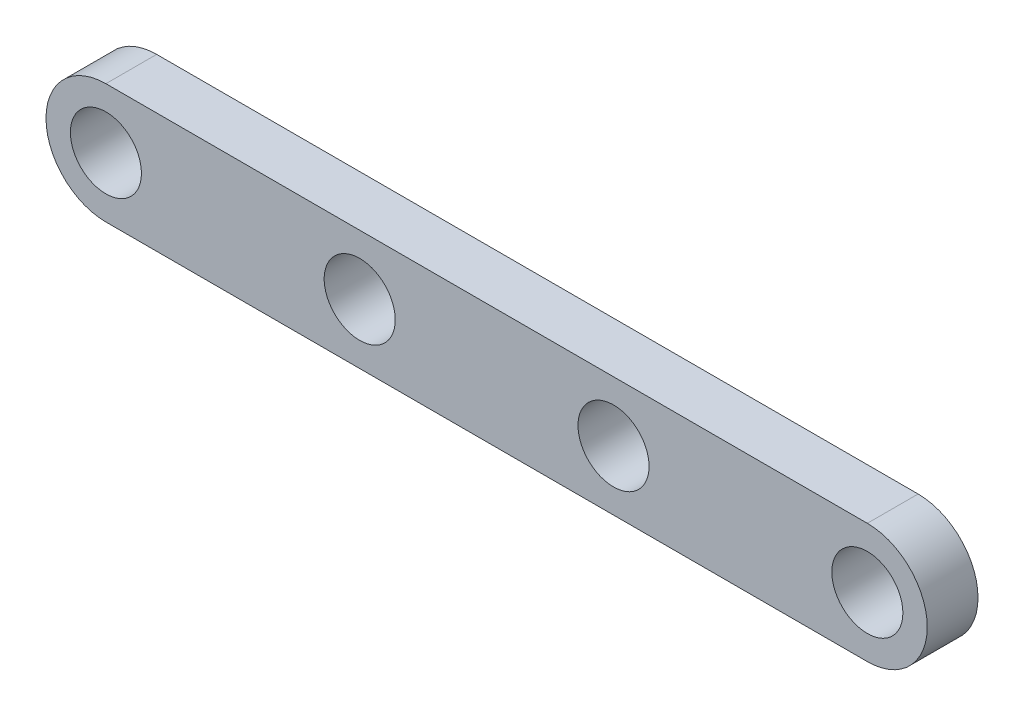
ISO-10303-21;
HEADER;
FILE_DESCRIPTION(('STEP AP214'),'2;1');
FILE_NAME('part.step','',(''),(''),'','','');
FILE_SCHEMA(('AUTOMOTIVE_DESIGN { 1 0 10303 214 1 1 1 1 }'));
ENDSEC;
DATA;
#1=APPLICATION_CONTEXT('core data for automotive mechanical design processes');
#2=APPLICATION_PROTOCOL_DEFINITION('international standard','automotive_design',2000,#1);
#3=PRODUCT_CONTEXT('',#1,'mechanical');
#4=PRODUCT('Part','Part','',(#3));
#5=PRODUCT_RELATED_PRODUCT_CATEGORY('part','',(#4));
#6=PRODUCT_DEFINITION_FORMATION('','',#4);
#7=PRODUCT_DEFINITION_CONTEXT('part definition',#1,'design');
#8=PRODUCT_DEFINITION('design','',#6,#7);
#9=PRODUCT_DEFINITION_SHAPE('','',#8);
#10=(LENGTH_UNIT() NAMED_UNIT(*) SI_UNIT(.MILLI.,.METRE.));
#11=(NAMED_UNIT(*) PLANE_ANGLE_UNIT() SI_UNIT($,.RADIAN.));
#12=(NAMED_UNIT(*) SI_UNIT($,.STERADIAN.) SOLID_ANGLE_UNIT());
#13=UNCERTAINTY_MEASURE_WITH_UNIT(LENGTH_MEASURE(1.E-05),#10,'distance_accuracy_value','');
#14=(GEOMETRIC_REPRESENTATION_CONTEXT(3) GLOBAL_UNCERTAINTY_ASSIGNED_CONTEXT((#13)) GLOBAL_UNIT_ASSIGNED_CONTEXT((#10,
#11,#12)) REPRESENTATION_CONTEXT('',''));
#15=CARTESIAN_POINT('',(0.,0.,0.));
#16=DIRECTION('',(0.,0.,1.));
#17=DIRECTION('',(1.,0.,0.));
#18=AXIS2_PLACEMENT_3D('',#15,#16,#17);
#19=CARTESIAN_POINT('',(261.537880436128,51.30188514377,2.54));
#20=DIRECTION('',(0.,0.,-1.));
#21=DIRECTION('',(-1.,0.,0.));
#22=AXIS2_PLACEMENT_3D('',#19,#20,#21);
#23=CYLINDRICAL_SURFACE('',#22,2.99720000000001);
#24=CARTESIAN_POINT('',(261.537880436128,51.30188514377,0.));
#25=DIRECTION('',(0.,0.,1.));
#26=DIRECTION('',(1.,0.,0.));
#27=AXIS2_PLACEMENT_3D('',#24,#25,#26);
#28=CIRCLE('',#27,2.99720000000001);
#29=CARTESIAN_POINT('',(261.537880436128,48.30468514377,0.));
#30=VERTEX_POINT('',#29);
#31=CARTESIAN_POINT('',(261.537880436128,54.2990851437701,0.));
#32=VERTEX_POINT('',#31);
#33=EDGE_CURVE('E96',#30,#32,#28,.T.);
#34=ORIENTED_EDGE('',*,*,#33,.T.);
#35=DIRECTION('',(0.,0.,-1.));
#36=VECTOR('',#35,1.);
#37=CARTESIAN_POINT('',(261.537880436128,54.2990851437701,2.54));
#38=LINE('',#37,#36);
#39=CARTESIAN_POINT('',(261.537880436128,54.2990851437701,2.54));
#40=VERTEX_POINT('',#39);
#41=EDGE_CURVE('E11',#40,#32,#38,.T.);
#42=ORIENTED_EDGE('',*,*,#41,.F.);
#43=CARTESIAN_POINT('',(261.537880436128,51.30188514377,2.54));
#44=DIRECTION('',(0.,0.,1.));
#45=DIRECTION('',(1.,0.,0.));
#46=AXIS2_PLACEMENT_3D('',#43,#44,#45);
#47=CIRCLE('',#46,2.99720000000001);
#48=CARTESIAN_POINT('',(261.537880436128,48.30468514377,2.54));
#49=VERTEX_POINT('',#48);
#50=EDGE_CURVE('E82',#49,#40,#47,.T.);
#51=ORIENTED_EDGE('',*,*,#50,.F.);
#52=DIRECTION('',(0.,0.,-1.));
#53=VECTOR('',#52,1.);
#54=CARTESIAN_POINT('',(261.537880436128,48.30468514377,2.54));
#55=LINE('',#54,#53);
#56=EDGE_CURVE('E49',#49,#30,#55,.T.);
#57=ORIENTED_EDGE('',*,*,#56,.T.);
#58=EDGE_LOOP('',(#34,#42,#51,#57));
#59=FACE_BOUND('',#58,.T.);
#60=ADVANCED_FACE('F33',(#59),#23,.T.);
#61=CARTESIAN_POINT('',(261.537880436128,54.2990851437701,2.54));
#62=DIRECTION('',(0.,-1.,0.));
#63=DIRECTION('',(1.,0.,0.));
#64=AXIS2_PLACEMENT_3D('',#61,#62,#63);
#65=PLANE('',#64);
#66=DIRECTION('',(-1.,0.,0.));
#67=VECTOR('',#66,1.);
#68=CARTESIAN_POINT('',(261.537880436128,54.2990851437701,0.));
#69=LINE('',#68,#67);
#70=CARTESIAN_POINT('',(223.437880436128,54.29908514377,0.));
#71=VERTEX_POINT('',#70);
#72=EDGE_CURVE('E87',#32,#71,#69,.T.);
#73=ORIENTED_EDGE('',*,*,#72,.T.);
#74=DIRECTION('',(0.,0.,-1.));
#75=VECTOR('',#74,1.);
#76=CARTESIAN_POINT('',(223.437880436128,54.29908514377,2.54));
#77=LINE('',#76,#75);
#78=CARTESIAN_POINT('',(223.437880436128,54.29908514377,2.54));
#79=VERTEX_POINT('',#78);
#80=EDGE_CURVE('E41',#79,#71,#77,.T.);
#81=ORIENTED_EDGE('',*,*,#80,.F.);
#82=DIRECTION('',(-1.,0.,0.));
#83=VECTOR('',#82,1.);
#84=CARTESIAN_POINT('',(261.537880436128,54.2990851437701,2.54));
#85=LINE('',#84,#83);
#86=EDGE_CURVE('E75',#40,#79,#85,.T.);
#87=ORIENTED_EDGE('',*,*,#86,.F.);
#88=ORIENTED_EDGE('',*,*,#41,.T.);
#89=EDGE_LOOP('',(#73,#81,#87,#88));
#90=FACE_BOUND('',#89,.T.);
#91=ADVANCED_FACE('F86',(#90),#65,.F.);
#92=CARTESIAN_POINT('',(223.437880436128,51.30188514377,2.54));
#93=DIRECTION('',(0.,0.,-1.));
#94=DIRECTION('',(-1.,0.,0.));
#95=AXIS2_PLACEMENT_3D('',#92,#93,#94);
#96=CYLINDRICAL_SURFACE('',#95,2.99719999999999);
#97=CARTESIAN_POINT('',(223.437880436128,51.30188514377,0.));
#98=DIRECTION('',(0.,0.,1.));
#99=DIRECTION('',(1.,0.,0.));
#100=AXIS2_PLACEMENT_3D('',#97,#98,#99);
#101=CIRCLE('',#100,2.99719999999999);
#102=CARTESIAN_POINT('',(223.437880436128,48.3046851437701,0.));
#103=VERTEX_POINT('',#102);
#104=EDGE_CURVE('E100',#71,#103,#101,.T.);
#105=ORIENTED_EDGE('',*,*,#104,.T.);
#106=DIRECTION('',(0.,0.,-1.));
#107=VECTOR('',#106,1.);
#108=CARTESIAN_POINT('',(223.437880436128,48.3046851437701,2.54));
#109=LINE('',#108,#107);
#110=CARTESIAN_POINT('',(223.437880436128,48.3046851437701,2.54));
#111=VERTEX_POINT('',#110);
#112=EDGE_CURVE('E64',#111,#103,#109,.T.);
#113=ORIENTED_EDGE('',*,*,#112,.F.);
#114=CARTESIAN_POINT('',(223.437880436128,51.30188514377,2.54));
#115=DIRECTION('',(0.,0.,1.));
#116=DIRECTION('',(1.,0.,0.));
#117=AXIS2_PLACEMENT_3D('',#114,#115,#116);
#118=CIRCLE('',#117,2.99719999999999);
#119=EDGE_CURVE('E81',#79,#111,#118,.T.);
#120=ORIENTED_EDGE('',*,*,#119,.F.);
#121=ORIENTED_EDGE('',*,*,#80,.T.);
#122=EDGE_LOOP('',(#105,#113,#120,#121));
#123=FACE_BOUND('',#122,.T.);
#124=ADVANCED_FACE('F90',(#123),#96,.T.);
#125=CARTESIAN_POINT('',(261.537880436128,48.30468514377,2.54));
#126=DIRECTION('',(0.,-1.,0.));
#127=DIRECTION('',(0.,0.,-1.));
#128=AXIS2_PLACEMENT_3D('',#125,#126,#127);
#129=PLANE('',#128);
#130=DIRECTION('',(-1.,0.,0.));
#131=VECTOR('',#130,1.);
#132=CARTESIAN_POINT('',(261.537880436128,48.30468514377,0.));
#133=LINE('',#132,#131);
#134=EDGE_CURVE('E102',#30,#103,#133,.T.);
#135=ORIENTED_EDGE('',*,*,#134,.F.);
#136=ORIENTED_EDGE('',*,*,#56,.F.);
#137=DIRECTION('',(-1.,0.,0.));
#138=VECTOR('',#137,1.);
#139=CARTESIAN_POINT('',(261.537880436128,48.30468514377,2.54));
#140=LINE('',#139,#138);
#141=EDGE_CURVE('E91',#49,#111,#140,.T.);
#142=ORIENTED_EDGE('',*,*,#141,.T.);
#143=ORIENTED_EDGE('',*,*,#112,.T.);
#144=EDGE_LOOP('',(#135,#136,#142,#143));
#145=FACE_BOUND('',#144,.T.);
#146=ADVANCED_FACE('F138',(#145),#129,.T.);
#147=CARTESIAN_POINT('',(261.537880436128,51.30188514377,2.54));
#148=DIRECTION('',(0.,0.,1.));
#149=DIRECTION('',(1.,0.,0.));
#150=AXIS2_PLACEMENT_3D('',#147,#148,#149);
#151=PLANE('',#150);
#152=CARTESIAN_POINT('',(223.437880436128,51.30188514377,2.54));
#153=DIRECTION('',(0.,0.,1.));
#154=DIRECTION('',(1.,0.,0.));
#155=AXIS2_PLACEMENT_3D('',#152,#153,#154);
#156=CIRCLE('',#155,1.778);
#157=CARTESIAN_POINT('',(225.215880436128,51.30188514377,2.54));
#158=VERTEX_POINT('',#157);
#159=EDGE_CURVE('E98',#158,#158,#156,.T.);
#160=ORIENTED_EDGE('',*,*,#159,.F.);
#161=EDGE_LOOP('',(#160));
#162=FACE_BOUND('',#161,.T.);
#163=CARTESIAN_POINT('',(236.137880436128,51.30188514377,2.54));
#164=DIRECTION('',(0.,0.,1.));
#165=DIRECTION('',(1.,0.,0.));
#166=AXIS2_PLACEMENT_3D('',#163,#164,#165);
#167=CIRCLE('',#166,1.778);
#168=CARTESIAN_POINT('',(237.915880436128,51.30188514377,2.54));
#169=VERTEX_POINT('',#168);
#170=EDGE_CURVE('E123',#169,#169,#167,.T.);
#171=ORIENTED_EDGE('',*,*,#170,.F.);
#172=EDGE_LOOP('',(#171));
#173=FACE_BOUND('',#172,.T.);
#174=CARTESIAN_POINT('',(248.837880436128,51.30188514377,2.54));
#175=DIRECTION('',(0.,0.,1.));
#176=DIRECTION('',(1.,0.,0.));
#177=AXIS2_PLACEMENT_3D('',#174,#175,#176);
#178=CIRCLE('',#177,1.77799999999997);
#179=CARTESIAN_POINT('',(250.615880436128,51.30188514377,2.54));
#180=VERTEX_POINT('',#179);
#181=EDGE_CURVE('E117',#180,#180,#178,.T.);
#182=ORIENTED_EDGE('',*,*,#181,.F.);
#183=EDGE_LOOP('',(#182));
#184=FACE_BOUND('',#183,.T.);
#185=CARTESIAN_POINT('',(261.537880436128,51.30188514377,2.54));
#186=DIRECTION('',(0.,0.,1.));
#187=DIRECTION('',(1.,0.,0.));
#188=AXIS2_PLACEMENT_3D('',#185,#186,#187);
#189=CIRCLE('',#188,1.778);
#190=CARTESIAN_POINT('',(263.315880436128,51.30188514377,2.54));
#191=VERTEX_POINT('',#190);
#192=EDGE_CURVE('E111',#191,#191,#189,.T.);
#193=ORIENTED_EDGE('',*,*,#192,.F.);
#194=EDGE_LOOP('',(#193));
#195=FACE_BOUND('',#194,.T.);
#196=ORIENTED_EDGE('',*,*,#50,.T.);
#197=ORIENTED_EDGE('',*,*,#86,.T.);
#198=ORIENTED_EDGE('',*,*,#119,.T.);
#199=ORIENTED_EDGE('',*,*,#141,.F.);
#200=EDGE_LOOP('',(#196,#197,#198,#199));
#201=FACE_BOUND('',#200,.T.);
#202=ADVANCED_FACE('F78',(#162,#173,#184,#195,#201),#151,.T.);
#203=CARTESIAN_POINT('',(261.537880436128,51.30188514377,0.));
#204=DIRECTION('',(0.,0.,1.));
#205=DIRECTION('',(1.,0.,0.));
#206=AXIS2_PLACEMENT_3D('',#203,#204,#205);
#207=PLANE('',#206);
#208=CARTESIAN_POINT('',(223.437880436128,51.30188514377,0.));
#209=DIRECTION('',(0.,0.,1.));
#210=DIRECTION('',(1.,0.,0.));
#211=AXIS2_PLACEMENT_3D('',#208,#209,#210);
#212=CIRCLE('',#211,1.778);
#213=CARTESIAN_POINT('',(225.215880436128,51.30188514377,0.));
#214=VERTEX_POINT('',#213);
#215=EDGE_CURVE('E126',#214,#214,#212,.T.);
#216=ORIENTED_EDGE('',*,*,#215,.T.);
#217=EDGE_LOOP('',(#216));
#218=FACE_BOUND('',#217,.T.);
#219=CARTESIAN_POINT('',(236.137880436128,51.30188514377,0.));
#220=DIRECTION('',(0.,0.,1.));
#221=DIRECTION('',(1.,0.,0.));
#222=AXIS2_PLACEMENT_3D('',#219,#220,#221);
#223=CIRCLE('',#222,1.778);
#224=CARTESIAN_POINT('',(237.915880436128,51.30188514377,0.));
#225=VERTEX_POINT('',#224);
#226=EDGE_CURVE('E120',#225,#225,#223,.T.);
#227=ORIENTED_EDGE('',*,*,#226,.T.);
#228=EDGE_LOOP('',(#227));
#229=FACE_BOUND('',#228,.T.);
#230=CARTESIAN_POINT('',(248.837880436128,51.30188514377,0.));
#231=DIRECTION('',(0.,0.,1.));
#232=DIRECTION('',(1.,0.,0.));
#233=AXIS2_PLACEMENT_3D('',#230,#231,#232);
#234=CIRCLE('',#233,1.77799999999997);
#235=CARTESIAN_POINT('',(250.615880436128,51.30188514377,0.));
#236=VERTEX_POINT('',#235);
#237=EDGE_CURVE('E114',#236,#236,#234,.T.);
#238=ORIENTED_EDGE('',*,*,#237,.T.);
#239=EDGE_LOOP('',(#238));
#240=FACE_BOUND('',#239,.T.);
#241=CARTESIAN_POINT('',(261.537880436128,51.30188514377,0.));
#242=DIRECTION('',(0.,0.,1.));
#243=DIRECTION('',(1.,0.,0.));
#244=AXIS2_PLACEMENT_3D('',#241,#242,#243);
#245=CIRCLE('',#244,1.778);
#246=CARTESIAN_POINT('',(263.315880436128,51.30188514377,0.));
#247=VERTEX_POINT('',#246);
#248=EDGE_CURVE('E108',#247,#247,#245,.T.);
#249=ORIENTED_EDGE('',*,*,#248,.T.);
#250=EDGE_LOOP('',(#249));
#251=FACE_BOUND('',#250,.T.);
#252=ORIENTED_EDGE('',*,*,#33,.F.);
#253=ORIENTED_EDGE('',*,*,#134,.T.);
#254=ORIENTED_EDGE('',*,*,#104,.F.);
#255=ORIENTED_EDGE('',*,*,#72,.F.);
#256=EDGE_LOOP('',(#252,#253,#254,#255));
#257=FACE_BOUND('',#256,.T.);
#258=ADVANCED_FACE('F137',(#218,#229,#240,#251,#257),#207,.F.);
#259=CARTESIAN_POINT('',(261.537880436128,51.30188514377,2.54));
#260=DIRECTION('',(0.,0.,-1.));
#261=DIRECTION('',(-1.,0.,0.));
#262=AXIS2_PLACEMENT_3D('',#259,#260,#261);
#263=CYLINDRICAL_SURFACE('',#262,1.778);
#264=ORIENTED_EDGE('',*,*,#192,.T.);
#265=EDGE_LOOP('',(#264));
#266=FACE_BOUND('',#265,.T.);
#267=ORIENTED_EDGE('',*,*,#248,.F.);
#268=EDGE_LOOP('',(#267));
#269=FACE_BOUND('',#268,.T.);
#270=ADVANCED_FACE('F146',(#266,#269),#263,.F.);
#271=CARTESIAN_POINT('',(248.837880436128,51.30188514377,2.54));
#272=DIRECTION('',(0.,0.,-1.));
#273=DIRECTION('',(-1.,0.,0.));
#274=AXIS2_PLACEMENT_3D('',#271,#272,#273);
#275=CYLINDRICAL_SURFACE('',#274,1.77799999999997);
#276=ORIENTED_EDGE('',*,*,#181,.T.);
#277=EDGE_LOOP('',(#276));
#278=FACE_BOUND('',#277,.T.);
#279=ORIENTED_EDGE('',*,*,#237,.F.);
#280=EDGE_LOOP('',(#279));
#281=FACE_BOUND('',#280,.T.);
#282=ADVANCED_FACE('F149',(#278,#281),#275,.F.);
#283=CARTESIAN_POINT('',(236.137880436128,51.30188514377,2.54));
#284=DIRECTION('',(0.,0.,-1.));
#285=DIRECTION('',(-1.,0.,0.));
#286=AXIS2_PLACEMENT_3D('',#283,#284,#285);
#287=CYLINDRICAL_SURFACE('',#286,1.778);
#288=ORIENTED_EDGE('',*,*,#170,.T.);
#289=EDGE_LOOP('',(#288));
#290=FACE_BOUND('',#289,.T.);
#291=ORIENTED_EDGE('',*,*,#226,.F.);
#292=EDGE_LOOP('',(#291));
#293=FACE_BOUND('',#292,.T.);
#294=ADVANCED_FACE('F203',(#290,#293),#287,.F.);
#295=CARTESIAN_POINT('',(223.437880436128,51.30188514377,2.54));
#296=DIRECTION('',(0.,0.,-1.));
#297=DIRECTION('',(-1.,0.,0.));
#298=AXIS2_PLACEMENT_3D('',#295,#296,#297);
#299=CYLINDRICAL_SURFACE('',#298,1.778);
#300=ORIENTED_EDGE('',*,*,#159,.T.);
#301=EDGE_LOOP('',(#300));
#302=FACE_BOUND('',#301,.T.);
#303=ORIENTED_EDGE('',*,*,#215,.F.);
#304=EDGE_LOOP('',(#303));
#305=FACE_BOUND('',#304,.T.);
#306=ADVANCED_FACE('F132',(#302,#305),#299,.F.);
#307=CLOSED_SHELL('',(#60,#91,#124,#146,#202,#258,#270,#282,#294,#306));
#308=MANIFOLD_SOLID_BREP('B2',#307);
#309=ADVANCED_BREP_SHAPE_REPRESENTATION('',(#18,#308),#14);
#310=SHAPE_DEFINITION_REPRESENTATION(#9,#309);
ENDSEC;
END-ISO-10303-21;
